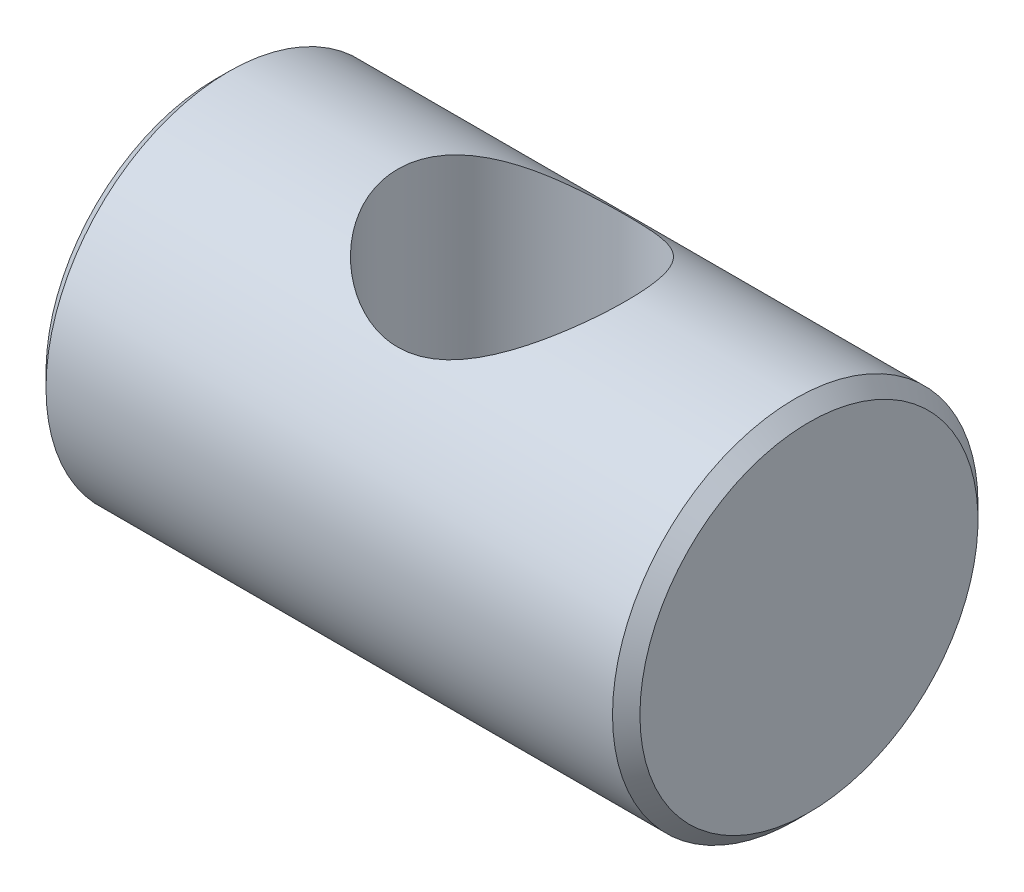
ISO-10303-21;
HEADER;
FILE_DESCRIPTION(('STEP AP214'),'2;1');
FILE_NAME('part.step','',(''),(''),'','','');
FILE_SCHEMA(('AUTOMOTIVE_DESIGN { 1 0 10303 214 1 1 1 1 }'));
ENDSEC;
DATA;
#1=APPLICATION_CONTEXT('core data for automotive mechanical design processes');
#2=APPLICATION_PROTOCOL_DEFINITION('international standard','automotive_design',2000,#1);
#3=PRODUCT_CONTEXT('',#1,'mechanical');
#4=PRODUCT('Part','Part','',(#3));
#5=PRODUCT_RELATED_PRODUCT_CATEGORY('part','',(#4));
#6=PRODUCT_DEFINITION_FORMATION('','',#4);
#7=PRODUCT_DEFINITION_CONTEXT('part definition',#1,'design');
#8=PRODUCT_DEFINITION('design','',#6,#7);
#9=PRODUCT_DEFINITION_SHAPE('','',#8);
#10=(LENGTH_UNIT() NAMED_UNIT(*) SI_UNIT(.MILLI.,.METRE.));
#11=(NAMED_UNIT(*) PLANE_ANGLE_UNIT() SI_UNIT($,.RADIAN.));
#12=(NAMED_UNIT(*) SI_UNIT($,.STERADIAN.) SOLID_ANGLE_UNIT());
#13=UNCERTAINTY_MEASURE_WITH_UNIT(LENGTH_MEASURE(1.E-05),#10,'distance_accuracy_value','');
#14=(GEOMETRIC_REPRESENTATION_CONTEXT(3) GLOBAL_UNCERTAINTY_ASSIGNED_CONTEXT((#13)) GLOBAL_UNIT_ASSIGNED_CONTEXT((#10,
#11,#12)) REPRESENTATION_CONTEXT('',''));
#15=CARTESIAN_POINT('',(0.,0.,0.));
#16=DIRECTION('',(0.,0.,1.));
#17=DIRECTION('',(1.,0.,0.));
#18=AXIS2_PLACEMENT_3D('',#15,#16,#17);
#19=CARTESIAN_POINT('',(6.5,3.7,0.));
#20=DIRECTION('',(-1.,0.,0.));
#21=DIRECTION('',(0.,0.,1.));
#22=AXIS2_PLACEMENT_3D('',#19,#20,#21);
#23=PLANE('',#22);
#24=CARTESIAN_POINT('',(6.50000000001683,0.,0.));
#25=DIRECTION('',(-1.,0.,0.));
#26=DIRECTION('',(0.,0.,1.));
#27=AXIS2_PLACEMENT_3D('',#24,#25,#26);
#28=CIRCLE('',#27,3.70000000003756);
#29=CARTESIAN_POINT('',(6.50000000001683,0.,3.70000000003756));
#30=VERTEX_POINT('',#29);
#31=EDGE_CURVE('E64',#30,#30,#28,.T.);
#32=ORIENTED_EDGE('',*,*,#31,.F.);
#33=EDGE_LOOP('',(#32));
#34=FACE_BOUND('',#33,.T.);
#35=ADVANCED_FACE('F14',(#34),#23,.F.);
#36=CARTESIAN_POINT('',(-6.5,0.,0.));
#37=DIRECTION('',(1.,0.,0.));
#38=DIRECTION('',(0.,0.,-1.));
#39=AXIS2_PLACEMENT_3D('',#36,#37,#38);
#40=PLANE('',#39);
#41=CARTESIAN_POINT('',(-6.49999999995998,0.,0.));
#42=DIRECTION('',(1.,0.,0.));
#43=DIRECTION('',(0.,1.,0.));
#44=AXIS2_PLACEMENT_3D('',#41,#42,#43);
#45=CIRCLE('',#44,3.70000000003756);
#46=CARTESIAN_POINT('',(-6.49999999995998,3.70000000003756,0.));
#47=VERTEX_POINT('',#46);
#48=EDGE_CURVE('E66',#47,#47,#45,.T.);
#49=ORIENTED_EDGE('',*,*,#48,.F.);
#50=EDGE_LOOP('',(#49));
#51=FACE_BOUND('',#50,.T.);
#52=ADVANCED_FACE('F55',(#51),#40,.F.);
#53=CARTESIAN_POINT('',(6.19999999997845,0.,0.));
#54=DIRECTION('',(-1.,0.,0.));
#55=DIRECTION('',(0.,0.,1.));
#56=AXIS2_PLACEMENT_3D('',#53,#54,#55);
#57=CONICAL_SURFACE('',#56,4.0000000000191,0.78539816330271);
#58=CARTESIAN_POINT('',(6.2,0.,0.));
#59=DIRECTION('',(1.,0.,0.));
#60=DIRECTION('',(0.,0.,-1.));
#61=AXIS2_PLACEMENT_3D('',#58,#59,#60);
#62=CIRCLE('',#61,4.);
#63=CARTESIAN_POINT('',(6.2,0.,-4.));
#64=VERTEX_POINT('',#63);
#65=EDGE_CURVE('E33',#64,#64,#62,.F.);
#66=ORIENTED_EDGE('',*,*,#65,.F.);
#67=EDGE_LOOP('',(#66));
#68=FACE_BOUND('',#67,.T.);
#69=ORIENTED_EDGE('',*,*,#31,.T.);
#70=EDGE_LOOP('',(#69));
#71=FACE_BOUND('',#70,.T.);
#72=ADVANCED_FACE('F60',(#68,#71),#57,.T.);
#73=CARTESIAN_POINT('',(-6.20000000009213,0.,0.));
#74=DIRECTION('',(1.,0.,0.));
#75=DIRECTION('',(0.,1.,0.));
#76=AXIS2_PLACEMENT_3D('',#73,#74,#75);
#77=CONICAL_SURFACE('',#76,3.99999999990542,0.785398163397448);
#78=ORIENTED_EDGE('',*,*,#48,.T.);
#79=EDGE_LOOP('',(#78));
#80=FACE_BOUND('',#79,.T.);
#81=CARTESIAN_POINT('',(-6.2,0.,0.));
#82=DIRECTION('',(1.,0.,0.));
#83=DIRECTION('',(0.,0.,-1.));
#84=AXIS2_PLACEMENT_3D('',#81,#82,#83);
#85=CIRCLE('',#84,4.);
#86=CARTESIAN_POINT('',(-6.2,0.,-4.));
#87=VERTEX_POINT('',#86);
#88=EDGE_CURVE('E29',#87,#87,#85,.T.);
#89=ORIENTED_EDGE('',*,*,#88,.F.);
#90=EDGE_LOOP('',(#89));
#91=FACE_BOUND('',#90,.T.);
#92=ADVANCED_FACE('F52',(#80,#91),#77,.T.);
#93=CARTESIAN_POINT('',(6.5,0.,0.));
#94=DIRECTION('',(1.,0.,0.));
#95=DIRECTION('',(0.,0.,-1.));
#96=AXIS2_PLACEMENT_3D('',#93,#94,#95);
#97=CYLINDRICAL_SURFACE('',#96,4.);
#98=CARTESIAN_POINT('',(2.5,-4.,0.));
#99=CARTESIAN_POINT('',(2.49998952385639,-3.99999041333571,0.127017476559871));
#100=CARTESIAN_POINT('',(2.49025350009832,-3.9938860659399,0.254191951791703));
#101=CARTESIAN_POINT('',(2.45182887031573,-3.97004375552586,0.504637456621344));
#102=CARTESIAN_POINT('',(2.4231041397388,-3.95228361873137,0.627900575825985));
#103=CARTESIAN_POINT('',(2.34837714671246,-3.90691695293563,0.866410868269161));
#104=CARTESIAN_POINT('',(2.30246039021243,-3.87935918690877,0.981694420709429));
#105=CARTESIAN_POINT('',(2.19522833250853,-3.81669199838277,1.20252080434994));
#106=CARTESIAN_POINT('',(2.13391473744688,-3.7815834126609,1.30806471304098));
#107=CARTESIAN_POINT('',(1.9922268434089,-3.70340304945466,1.51594836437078));
#108=CARTESIAN_POINT('',(1.91072139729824,-3.65991924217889,1.61735911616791));
#109=CARTESIAN_POINT('',(1.73356165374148,-3.57062700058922,1.80597275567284));
#110=CARTESIAN_POINT('',(1.63788834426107,-3.52481549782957,1.89315621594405));
#111=CARTESIAN_POINT('',(1.4199322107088,-3.42860837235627,2.06285746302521));
#112=CARTESIAN_POINT('',(1.29580042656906,-3.37843221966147,2.14314412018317));
#113=CARTESIAN_POINT('',(1.03287036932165,-3.28660396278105,2.28147932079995));
#114=CARTESIAN_POINT('',(0.894097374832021,-3.2449375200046,2.33956541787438));
#115=CARTESIAN_POINT('',(0.642378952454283,-3.18619151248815,2.41866801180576));
#116=CARTESIAN_POINT('',(0.532066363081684,-3.16553811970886,2.44539104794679));
#117=CARTESIAN_POINT('',(0.307388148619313,-3.1356271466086,2.4836368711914));
#118=CARTESIAN_POINT('',(0.193028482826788,-3.12635347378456,2.49518112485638));
#119=CARTESIAN_POINT('',(-0.0368260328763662,-3.12059771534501,2.50237836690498));
#120=CARTESIAN_POINT('',(-0.152323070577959,-3.12414917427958,2.49798968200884));
#121=CARTESIAN_POINT('',(-0.380620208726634,-3.14354804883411,2.47352633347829));
#122=CARTESIAN_POINT('',(-0.493418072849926,-3.15940531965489,2.45343909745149));
#123=CARTESIAN_POINT('',(-0.710876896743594,-3.20065145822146,2.3993620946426));
#124=CARTESIAN_POINT('',(-0.815664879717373,-3.22581428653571,2.36570043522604));
#125=CARTESIAN_POINT('',(-1.01832239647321,-3.28291134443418,2.28580369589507));
#126=CARTESIAN_POINT('',(-1.11618946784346,-3.31484796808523,2.2395641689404));
#127=CARTESIAN_POINT('',(-1.32166640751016,-3.38909625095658,2.12589830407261));
#128=CARTESIAN_POINT('',(-1.42768105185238,-3.4322315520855,2.05612773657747));
#129=CARTESIAN_POINT('',(-1.6276611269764,-3.52011451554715,1.90176111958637));
#130=CARTESIAN_POINT('',(-1.72161400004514,-3.56486379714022,1.81714983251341));
#131=CARTESIAN_POINT('',(-1.91060100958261,-3.65959667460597,1.61904732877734));
#132=CARTESIAN_POINT('',(-2.0032559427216,-3.70922571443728,1.50309447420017));
#133=CARTESIAN_POINT('',(-2.16771179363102,-3.8005660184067,1.25426444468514));
#134=CARTESIAN_POINT('',(-2.23952090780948,-3.84228039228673,1.12139395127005));
#135=CARTESIAN_POINT('',(-2.32734595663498,-3.89435975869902,0.915775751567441));
#136=CARTESIAN_POINT('',(-2.3528342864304,-3.90966874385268,0.848193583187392));
#137=CARTESIAN_POINT('',(-2.39800765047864,-3.93701839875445,0.710492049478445));
#138=CARTESIAN_POINT('',(-2.41769603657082,-3.94906095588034,0.640374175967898));
#139=CARTESIAN_POINT('',(-2.45093416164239,-3.96949699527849,0.498239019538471));
#140=CARTESIAN_POINT('',(-2.464489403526,-3.97789374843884,0.426223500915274));
#141=CARTESIAN_POINT('',(-2.48524629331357,-3.99078766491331,0.280965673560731));
#142=CARTESIAN_POINT('',(-2.49244902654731,-3.99528549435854,0.207723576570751));
#143=CARTESIAN_POINT('',(-2.50310930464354,-4.00193773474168,0.00911917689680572));
#144=CARTESIAN_POINT('',(-2.50040036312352,-4.000238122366,-0.116782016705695));
#145=CARTESIAN_POINT('',(-2.47624033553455,-3.98518313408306,-0.365967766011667));
#146=CARTESIAN_POINT('',(-2.45479052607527,-3.97182855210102,-0.489252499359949));
#147=CARTESIAN_POINT('',(-2.39552141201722,-3.93547975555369,-0.7250361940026));
#148=CARTESIAN_POINT('',(-2.35837527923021,-3.91288306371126,-0.837768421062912));
#149=CARTESIAN_POINT('',(-2.26940762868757,-3.85991402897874,-1.05527816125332));
#150=CARTESIAN_POINT('',(-2.21758365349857,-3.82954038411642,-1.16005433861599));
#151=CARTESIAN_POINT('',(-2.09496946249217,-3.75980014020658,-1.37016761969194));
#152=CARTESIAN_POINT('',(-2.02279282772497,-3.71983526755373,-1.47449380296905));
#153=CARTESIAN_POINT('',(-1.86441230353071,-3.63613942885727,-1.67028541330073));
#154=CARTESIAN_POINT('',(-1.77819283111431,-3.59240430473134,-1.76173634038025));
#155=CARTESIAN_POINT('',(-1.57972991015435,-3.49811738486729,-1.94294835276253));
#156=CARTESIAN_POINT('',(-1.46552558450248,-3.44749766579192,-2.03053702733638));
#157=CARTESIAN_POINT('',(-1.22224843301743,-3.35133525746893,-2.18560704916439));
#158=CARTESIAN_POINT('',(-1.09318598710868,-3.30578906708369,-2.25310231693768));
#159=CARTESIAN_POINT('',(-0.850615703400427,-3.23467060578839,-2.35369543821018));
#160=CARTESIAN_POINT('',(-0.739518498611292,-3.20691272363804,-2.39103791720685));
#161=CARTESIAN_POINT('',(-0.511213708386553,-3.16210061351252,-2.45000216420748));
#162=CARTESIAN_POINT('',(-0.394015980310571,-3.1450296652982,-2.47164849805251));
#163=CARTESIAN_POINT('',(-0.155819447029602,-3.12412649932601,-2.49802767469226));
#164=CARTESIAN_POINT('',(-0.0348028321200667,-3.12037003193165,-2.50266374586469));
#165=CARTESIAN_POINT('',(0.206261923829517,-3.12698126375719,-2.49439556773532));
#166=CARTESIAN_POINT('',(0.326309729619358,-3.13735365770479,-2.48148548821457));
#167=CARTESIAN_POINT('',(0.552059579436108,-3.16910777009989,-2.44076547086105));
#168=CARTESIAN_POINT('',(0.658138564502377,-3.18953614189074,-2.41423847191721));
#169=CARTESIAN_POINT('',(0.864270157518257,-3.23835062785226,-2.34835238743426));
#170=CARTESIAN_POINT('',(0.964320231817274,-3.26674005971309,-2.30898795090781));
#171=CARTESIAN_POINT('',(1.17119332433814,-3.33327797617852,-2.21205415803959));
#172=CARTESIAN_POINT('',(1.27689994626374,-3.3722442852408,-2.15267427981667));
#173=CARTESIAN_POINT('',(1.47787738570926,-3.45335445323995,-2.01999894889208));
#174=CARTESIAN_POINT('',(1.57313966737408,-3.49550086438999,-1.94669224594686));
#175=CARTESIAN_POINT('',(1.77002558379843,-3.58803675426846,-1.77134669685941));
#176=CARTESIAN_POINT('',(1.86916976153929,-3.63840488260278,-1.66649284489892));
#177=CARTESIAN_POINT('',(2.04900159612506,-3.7339805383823,-1.43961937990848));
#178=CARTESIAN_POINT('',(2.12967782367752,-3.77918486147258,-1.3175892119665));
#179=CARTESIAN_POINT('',(2.23456343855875,-3.83959214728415,-1.12346357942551));
#180=CARTESIAN_POINT('',(2.26687480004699,-3.85851834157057,-1.05679601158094));
#181=CARTESIAN_POINT('',(2.32567225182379,-3.89335165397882,-0.920199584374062));
#182=CARTESIAN_POINT('',(2.3521617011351,-3.9092605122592,-0.850272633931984));
#183=CARTESIAN_POINT('',(2.39885714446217,-3.93753374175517,-0.707873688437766));
#184=CARTESIAN_POINT('',(2.41908005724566,-3.94990764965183,-0.635409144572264));
#185=CARTESIAN_POINT('',(2.45297545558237,-3.97075677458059,-0.488456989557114));
#186=CARTESIAN_POINT('',(2.46665277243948,-3.97923486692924,-0.413970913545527));
#187=CARTESIAN_POINT('',(2.48459041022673,-3.99038271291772,-0.28285260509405));
#188=CARTESIAN_POINT('',(2.49036153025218,-3.99398159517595,-0.226501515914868));
#189=CARTESIAN_POINT('',(2.49806878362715,-3.99879245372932,-0.113444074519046));
#190=CARTESIAN_POINT('',(2.50000467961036,-4.00000428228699,-0.0567377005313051));
#191=CARTESIAN_POINT('',(2.5,-4.,0.));
#192=B_SPLINE_CURVE_WITH_KNOTS('',3,(#98,#99,#100,#101,#102,#103,#104,#105,#106,#107,#108,#109,
#110,#111,#112,#113,#114,#115,#116,#117,#118,#119,#120,#121,#122,#123,#124,#125,#126,#127,#128,
#129,#130,#131,#132,#133,#134,#135,#136,#137,#138,#139,#140,#141,#142,#143,#144,#145,#146,#147,
#148,#149,#150,#151,#152,#153,#154,#155,#156,#157,#158,#159,#160,#161,#162,#163,#164,#165,#166,
#167,#168,#169,#170,#171,#172,#173,#174,#175,#176,#177,#178,#179,#180,#181,#182,#183,#184,#185,
#186,#187,#188,#189,#190,#191),.UNSPECIFIED.,.T.,.F.,(4,2,2,2,2,2,2,2,2,2,2,2,2,2,2,2,2,2,2,2,2,
2,2,2,2,2,2,2,2,2,2,2,2,2,2,2,2,2,2,2,2,2,2,2,2,2,4),(0.,0.380824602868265,0.762375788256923,
1.14205397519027,1.52169010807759,1.93164374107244,2.34215256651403,2.80825951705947,
3.27357449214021,3.61824017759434,3.96241789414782,4.30749646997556,4.65285169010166,
4.99031678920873,5.32790135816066,5.72854900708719,6.12961045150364,6.59684361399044,
7.06389281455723,7.28510978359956,7.50619865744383,7.72708876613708,7.94794112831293,
8.32363778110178,8.69930884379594,9.06028425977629,9.42132014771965,9.81879878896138,
10.216721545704,10.6724083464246,11.1277787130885,11.4876929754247,11.8470427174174,
12.2084336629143,12.5699447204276,12.9023575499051,13.2349091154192,13.6156046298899,
13.9966089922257,14.4531049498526,14.9098826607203,15.1389848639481,15.3679545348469,
15.5963005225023,15.8244777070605,15.994578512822,16.1646898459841),.UNSPECIFIED.);
#193=CARTESIAN_POINT('',(2.5,-4.,0.));
#194=VERTEX_POINT('',#193);
#195=EDGE_CURVE('E10',#194,#194,#192,.T.);
#196=ORIENTED_EDGE('',*,*,#195,.F.);
#197=EDGE_LOOP('',(#196));
#198=FACE_BOUND('',#197,.T.);
#199=CARTESIAN_POINT('',(0.,3.1224989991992,2.5));
#200=CARTESIAN_POINT('',(0.0621567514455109,3.12249991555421,2.49999941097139));
#201=CARTESIAN_POINT('',(0.124325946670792,3.12436490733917,2.49767581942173));
#202=CARTESIAN_POINT('',(0.248117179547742,3.13172923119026,2.48843349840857));
#203=CARTESIAN_POINT('',(0.309738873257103,3.13723070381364,2.48151206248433));
#204=CARTESIAN_POINT('',(0.493226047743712,3.15888953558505,2.45397595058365));
#205=CARTESIAN_POINT('',(0.613548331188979,3.18020036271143,2.42658990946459));
#206=CARTESIAN_POINT('',(0.845598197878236,3.23299770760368,2.35576217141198));
#207=CARTESIAN_POINT('',(0.957390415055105,3.26439575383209,2.31245961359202));
#208=CARTESIAN_POINT('',(1.17200852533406,3.3336600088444,2.21143916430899));
#209=CARTESIAN_POINT('',(1.27483417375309,3.37152639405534,2.15372087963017));
#210=CARTESIAN_POINT('',(1.48373398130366,3.45559225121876,2.01647682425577));
#211=CARTESIAN_POINT('',(1.58839332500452,3.50222814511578,1.93506425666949));
#212=CARTESIAN_POINT('',(1.7837615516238,3.59505503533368,1.75662526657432));
#213=CARTESIAN_POINT('',(1.87445827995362,3.64124561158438,1.65958538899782));
#214=CARTESIAN_POINT('',(2.05022029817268,3.73459524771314,1.43833990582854));
#215=CARTESIAN_POINT('',(2.13328618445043,3.78119887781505,1.31226934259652));
#216=CARTESIAN_POINT('',(2.24054515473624,3.84307251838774,1.11163395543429));
#217=CARTESIAN_POINT('',(2.27341513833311,3.86236283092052,1.04281240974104));
#218=CARTESIAN_POINT('',(2.33295468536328,3.89770436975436,0.901758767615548));
#219=CARTESIAN_POINT('',(2.35962853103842,3.91375783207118,0.829529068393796));
#220=CARTESIAN_POINT('',(2.40398381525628,3.94066759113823,0.689700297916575));
#221=CARTESIAN_POINT('',(2.42230197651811,3.95188535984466,0.622371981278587));
#222=CARTESIAN_POINT('',(2.45330228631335,3.97096241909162,0.485997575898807));
#223=CARTESIAN_POINT('',(2.46598768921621,3.97882364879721,0.416952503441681));
#224=CARTESIAN_POINT('',(2.48551379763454,3.99095470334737,0.277765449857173));
#225=CARTESIAN_POINT('',(2.49235811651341,3.99522674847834,0.207624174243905));
#226=CARTESIAN_POINT('',(2.50009921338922,4.00006125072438,0.0669114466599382));
#227=CARTESIAN_POINT('',(2.50099667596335,4.00062413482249,-0.00365995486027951));
#228=CARTESIAN_POINT('',(2.49527462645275,3.99704479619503,-0.196045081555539));
#229=CARTESIAN_POINT('',(2.48269349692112,3.98917040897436,-0.317681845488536));
#230=CARTESIAN_POINT('',(2.44026978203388,3.96290903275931,-0.556636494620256));
#231=CARTESIAN_POINT('',(2.41042589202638,3.94452124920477,-0.673954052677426));
#232=CARTESIAN_POINT('',(2.33479144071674,3.89876170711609,-0.901771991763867));
#233=CARTESIAN_POINT('',(2.28896008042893,3.87136697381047,-1.01225407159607));
#234=CARTESIAN_POINT('',(2.18306276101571,3.80971291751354,-1.22404012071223));
#235=CARTESIAN_POINT('',(2.12299355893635,3.77545203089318,-1.32534199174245));
#236=CARTESIAN_POINT('',(1.98194358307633,3.69786441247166,-1.52942649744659));
#237=CARTESIAN_POINT('',(1.89929072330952,3.65394006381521,-1.63082454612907));
#238=CARTESIAN_POINT('',(1.71973526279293,3.56390927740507,-1.81919733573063));
#239=CARTESIAN_POINT('',(1.62281195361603,3.51779973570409,-1.90615071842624));
#240=CARTESIAN_POINT('',(1.40258874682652,3.42142883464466,-2.07470887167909));
#241=CARTESIAN_POINT('',(1.27749723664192,3.37141162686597,-2.15413229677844));
#242=CARTESIAN_POINT('',(1.01270776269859,3.28028278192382,-2.29052307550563));
#243=CARTESIAN_POINT('',(0.873037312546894,3.23915480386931,-2.34753179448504));
#244=CARTESIAN_POINT('',(0.620461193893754,3.18183753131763,-2.42437133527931));
#245=CARTESIAN_POINT('',(0.510178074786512,3.16193408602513,-2.45003683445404));
#246=CARTESIAN_POINT('',(0.285769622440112,3.13358277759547,-2.48620337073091));
#247=CARTESIAN_POINT('',(0.171649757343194,3.12511926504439,-2.49672512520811));
#248=CARTESIAN_POINT('',(-0.0574573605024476,3.12092267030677,-2.5019707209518));
#249=CARTESIAN_POINT('',(-0.172446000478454,3.12521876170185,-2.49665835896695));
#250=CARTESIAN_POINT('',(-0.399561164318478,3.14592085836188,-2.47051466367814));
#251=CARTESIAN_POINT('',(-0.511685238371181,3.16233689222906,-2.44967047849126));
#252=CARTESIAN_POINT('',(-0.728436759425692,3.20460120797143,-2.39409874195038));
#253=CARTESIAN_POINT('',(-0.833157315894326,3.23028954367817,-2.35960571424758));
#254=CARTESIAN_POINT('',(-1.03557469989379,3.28831148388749,-2.27804893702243));
#255=CARTESIAN_POINT('',(-1.13326901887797,3.32064744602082,-2.23098072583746));
#256=CARTESIAN_POINT('',(-1.33861194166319,3.39574401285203,-2.11530798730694));
#257=CARTESIAN_POINT('',(-1.44461452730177,3.43931724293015,-2.04430931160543));
#258=CARTESIAN_POINT('',(-1.64437066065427,3.52787943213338,-1.88737868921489));
#259=CARTESIAN_POINT('',(-1.73811132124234,3.57286982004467,-1.80143124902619));
#260=CARTESIAN_POINT('',(-1.92596407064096,3.66766209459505,-1.60076932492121));
#261=CARTESIAN_POINT('',(-2.0177273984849,3.71707933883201,-1.48365201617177));
#262=CARTESIAN_POINT('',(-2.18014701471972,3.80768973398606,-1.23256787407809));
#263=CARTESIAN_POINT('',(-2.25081319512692,3.84888673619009,-1.09860897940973));
#264=CARTESIAN_POINT('',(-2.33658106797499,3.89988966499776,-0.891930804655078));
#265=CARTESIAN_POINT('',(-2.36129744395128,3.91477055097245,-0.824318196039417));
#266=CARTESIAN_POINT('',(-2.40493827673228,3.94124643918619,-0.686640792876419));
#267=CARTESIAN_POINT('',(-2.42386608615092,3.95284334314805,-0.616577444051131));
#268=CARTESIAN_POINT('',(-2.45560583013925,3.9723851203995,-0.474639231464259));
#269=CARTESIAN_POINT('',(-2.46842309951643,3.98033317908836,-0.402766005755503));
#270=CARTESIAN_POINT('',(-2.4877391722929,3.99234168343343,-0.257881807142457));
#271=CARTESIAN_POINT('',(-2.49423902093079,3.99640277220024,-0.184871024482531));
#272=CARTESIAN_POINT('',(-2.50307151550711,4.00191521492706,0.0131102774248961));
#273=CARTESIAN_POINT('',(-2.49926579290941,3.99952706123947,0.138539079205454));
#274=CARTESIAN_POINT('',(-2.47308241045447,3.98321975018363,0.386583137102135));
#275=CARTESIAN_POINT('',(-2.45070559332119,3.96930111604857,0.509198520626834));
#276=CARTESIAN_POINT('',(-2.38967758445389,3.93192083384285,0.744080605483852));
#277=CARTESIAN_POINT('',(-2.35161792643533,3.90880701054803,0.856558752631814));
#278=CARTESIAN_POINT('',(-2.26088053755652,3.85489971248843,1.07343034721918));
#279=CARTESIAN_POINT('',(-2.2082003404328,3.82410494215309,1.17782242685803));
#280=CARTESIAN_POINT('',(-2.08367872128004,3.75350673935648,1.38731297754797));
#281=CARTESIAN_POINT('',(-2.0104160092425,3.71310001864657,1.4913601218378));
#282=CARTESIAN_POINT('',(-1.84984676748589,3.62867283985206,1.68643334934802));
#283=CARTESIAN_POINT('',(-1.76252439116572,3.58464833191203,1.77744451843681));
#284=CARTESIAN_POINT('',(-1.56176748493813,3.49000828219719,1.95744716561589));
#285=CARTESIAN_POINT('',(-1.44638338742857,3.43935738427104,2.04425661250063));
#286=CARTESIAN_POINT('',(-1.20071059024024,3.34349647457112,2.19754648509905));
#287=CARTESIAN_POINT('',(-1.07043018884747,3.2982834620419,2.26403815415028));
#288=CARTESIAN_POINT('',(-0.827194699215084,3.22859539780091,2.36198229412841));
#289=CARTESIAN_POINT('',(-0.716729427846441,3.20174639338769,2.39792458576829));
#290=CARTESIAN_POINT('',(-0.490060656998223,3.1587835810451,2.45425618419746));
#291=CARTESIAN_POINT('',(-0.37387658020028,3.14263581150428,2.47469472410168));
#292=CARTESIAN_POINT('',(-0.213940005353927,3.12952857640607,2.49119847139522));
#293=CARTESIAN_POINT('',(-0.171274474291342,3.1268999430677,2.49449433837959));
#294=CARTESIAN_POINT('',(-0.0857413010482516,3.12338461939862,2.49889558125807));
#295=CARTESIAN_POINT('',(-0.0428736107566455,3.12249836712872,2.50000040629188));
#296=CARTESIAN_POINT('',(0.,3.1224989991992,2.5));
#297=B_SPLINE_CURVE_WITH_KNOTS('',3,(#199,#200,#201,#202,#203,#204,#205,#206,#207,#208,#209,
#210,#211,#212,#213,#214,#215,#216,#217,#218,#219,#220,#221,#222,#223,#224,#225,#226,#227,#228,
#229,#230,#231,#232,#233,#234,#235,#236,#237,#238,#239,#240,#241,#242,#243,#244,#245,#246,#247,
#248,#249,#250,#251,#252,#253,#254,#255,#256,#257,#258,#259,#260,#261,#262,#263,#264,#265,#266,
#267,#268,#269,#270,#271,#272,#273,#274,#275,#276,#277,#278,#279,#280,#281,#282,#283,#284,#285,
#286,#287,#288,#289,#290,#291,#292,#293,#294,#295,#296),.UNSPECIFIED.,.T.,.F.,(4,2,2,2,2,2,2,2,
2,2,2,2,2,2,2,2,2,2,2,2,2,2,2,2,2,2,2,2,2,2,2,2,2,2,2,2,2,2,2,2,2,2,2,2,2,2,2,2,4),(0.,
0.186415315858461,0.372940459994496,0.746478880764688,1.11682668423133,1.48718459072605,
1.90722798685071,2.32763499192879,2.7987602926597,3.03445880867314,3.26999394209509,
3.48170145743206,3.69328649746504,3.90474055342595,4.11617026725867,4.48184709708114,
4.84755156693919,5.21419620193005,5.58092442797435,5.99329080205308,6.40626158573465,
6.87316206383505,7.33919680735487,7.68265621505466,8.02564530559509,8.36941921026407,
8.7134778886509,9.05186495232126,9.390372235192,9.79332737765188,10.1967026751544,
10.6647326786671,11.1325428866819,11.3527929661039,11.5729152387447,11.7928449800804,
12.0127383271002,12.3871595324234,12.7615637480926,13.1229788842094,13.4844550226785,
13.8834503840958,14.2828986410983,14.7399238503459,15.1966956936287,15.5530255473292,
15.9082190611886,16.0367696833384,16.1653526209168),.UNSPECIFIED.);
#298=CARTESIAN_POINT('',(0.,3.1224989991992,2.5));
#299=VERTEX_POINT('',#298);
#300=EDGE_CURVE('E25',#299,#299,#297,.T.);
#301=ORIENTED_EDGE('',*,*,#300,.F.);
#302=EDGE_LOOP('',(#301));
#303=FACE_BOUND('',#302,.T.);
#304=ORIENTED_EDGE('',*,*,#88,.T.);
#305=EDGE_LOOP('',(#304));
#306=FACE_BOUND('',#305,.T.);
#307=ORIENTED_EDGE('',*,*,#65,.T.);
#308=EDGE_LOOP('',(#307));
#309=FACE_BOUND('',#308,.T.);
#310=ADVANCED_FACE('F41',(#198,#303,#306,#309),#97,.T.);
#311=CARTESIAN_POINT('',(0.,-4.,0.));
#312=DIRECTION('',(0.,1.,0.));
#313=DIRECTION('',(0.,0.,1.));
#314=AXIS2_PLACEMENT_3D('',#311,#312,#313);
#315=CYLINDRICAL_SURFACE('',#314,2.5);
#316=ORIENTED_EDGE('',*,*,#195,.T.);
#317=EDGE_LOOP('',(#316));
#318=FACE_BOUND('',#317,.T.);
#319=ORIENTED_EDGE('',*,*,#300,.T.);
#320=EDGE_LOOP('',(#319));
#321=FACE_BOUND('',#320,.T.);
#322=ADVANCED_FACE('F44',(#318,#321),#315,.F.);
#323=CLOSED_SHELL('',(#35,#52,#72,#92,#310,#322));
#324=MANIFOLD_SOLID_BREP('B1',#323);
#325=ADVANCED_BREP_SHAPE_REPRESENTATION('',(#18,#324),#14);
#326=SHAPE_DEFINITION_REPRESENTATION(#9,#325);
ENDSEC;
END-ISO-10303-21;
